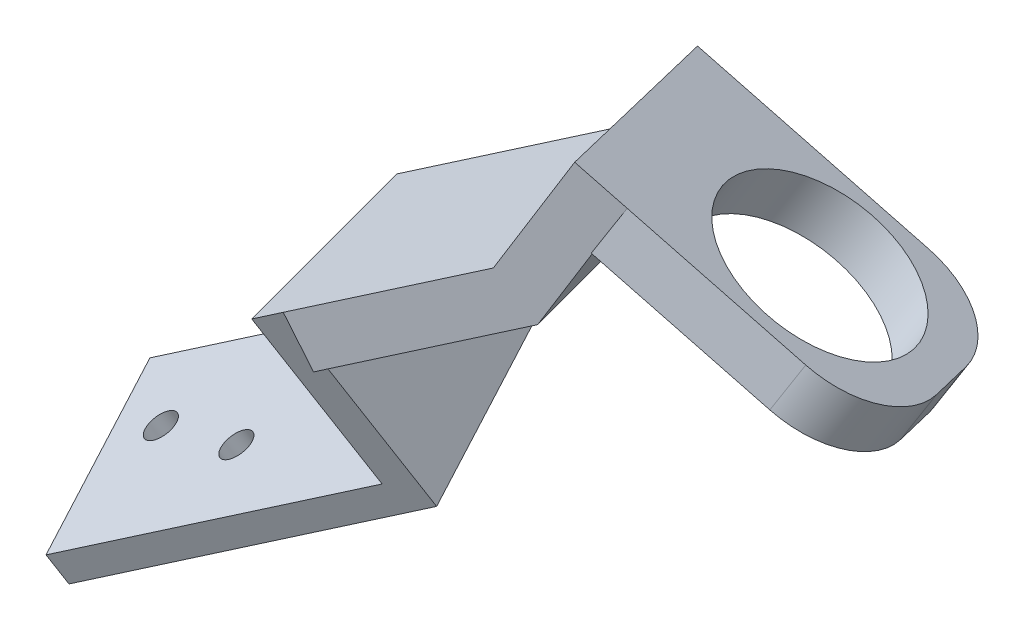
ISO-10303-21;
HEADER;
FILE_DESCRIPTION(('STEP AP214'),'2;1');
FILE_NAME('part.step','',(''),(''),'','','');
FILE_SCHEMA(('AUTOMOTIVE_DESIGN { 1 0 10303 214 1 1 1 1 }'));
ENDSEC;
DATA;
#1=APPLICATION_CONTEXT('core data for automotive mechanical design processes');
#2=APPLICATION_PROTOCOL_DEFINITION('international standard','automotive_design',2000,#1);
#3=PRODUCT_CONTEXT('',#1,'mechanical');
#4=PRODUCT('Part','Part','',(#3));
#5=PRODUCT_RELATED_PRODUCT_CATEGORY('part','',(#4));
#6=PRODUCT_DEFINITION_FORMATION('','',#4);
#7=PRODUCT_DEFINITION_CONTEXT('part definition',#1,'design');
#8=PRODUCT_DEFINITION('design','',#6,#7);
#9=PRODUCT_DEFINITION_SHAPE('','',#8);
#10=(LENGTH_UNIT() NAMED_UNIT(*) SI_UNIT(.MILLI.,.METRE.));
#11=(NAMED_UNIT(*) PLANE_ANGLE_UNIT() SI_UNIT($,.RADIAN.));
#12=(NAMED_UNIT(*) SI_UNIT($,.STERADIAN.) SOLID_ANGLE_UNIT());
#13=UNCERTAINTY_MEASURE_WITH_UNIT(LENGTH_MEASURE(1.E-05),#10,'distance_accuracy_value','');
#14=(GEOMETRIC_REPRESENTATION_CONTEXT(3) GLOBAL_UNCERTAINTY_ASSIGNED_CONTEXT((#13)) GLOBAL_UNIT_ASSIGNED_CONTEXT((#10,
#11,#12)) REPRESENTATION_CONTEXT('',''));
#15=CARTESIAN_POINT('',(0.,0.,0.));
#16=DIRECTION('',(0.,0.,1.));
#17=DIRECTION('',(1.,0.,0.));
#18=AXIS2_PLACEMENT_3D('',#15,#16,#17);
#19=CARTESIAN_POINT('',(-0.769203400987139,77.3547313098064,26.4639603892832));
#20=DIRECTION('',(-0.338752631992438,-0.15038373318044,-0.928779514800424));
#21=DIRECTION('',(-0.939463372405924,0.,0.342649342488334));
#22=AXIS2_PLACEMENT_3D('',#19,#20,#21);
#23=PLANE('',#22);
#24=DIRECTION('',(0.836516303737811,-0.499999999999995,-0.224143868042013));
#25=VECTOR('',#24,1.);
#26=CARTESIAN_POINT('',(-0.769203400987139,77.3547313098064,26.4639603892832));
#27=LINE('',#26,#25);
#28=CARTESIAN_POINT('',(-21.6821109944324,89.8547313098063,32.0675570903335));
#29=VERTEX_POINT('',#28);
#30=CARTESIAN_POINT('',(-7.46133383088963,81.3547313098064,28.2571113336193));
#31=VERTEX_POINT('',#30);
#32=EDGE_CURVE('E293',#29,#31,#27,.T.);
#33=ORIENTED_EDGE('',*,*,#32,.T.);
#34=DIRECTION('',(0.430682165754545,0.852868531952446,-0.295174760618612));
#35=VECTOR('',#34,1.);
#36=CARTESIAN_POINT('',(-7.46133383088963,81.3547313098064,28.2571113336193));
#37=LINE('',#36,#35);
#38=CARTESIAN_POINT('',(-5.30792300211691,85.6190739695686,26.7812375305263));
#39=VERTEX_POINT('',#38);
#40=EDGE_CURVE('E165',#31,#39,#37,.T.);
#41=ORIENTED_EDGE('',*,*,#40,.T.);
#42=DIRECTION('',(0.836516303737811,-0.499999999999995,-0.224143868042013));
#43=VECTOR('',#42,1.);
#44=CARTESIAN_POINT('',(1.38420742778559,81.6190739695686,24.9880865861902));
#45=LINE('',#44,#43);
#46=CARTESIAN_POINT('',(-19.5287001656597,94.1190739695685,30.5916832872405));
#47=VERTEX_POINT('',#46);
#48=EDGE_CURVE('E159',#47,#39,#45,.T.);
#49=ORIENTED_EDGE('',*,*,#48,.F.);
#50=DIRECTION('',(0.430682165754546,0.852868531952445,-0.295174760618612));
#51=VECTOR('',#50,1.);
#52=CARTESIAN_POINT('',(-21.6821109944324,89.8547313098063,32.0675570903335));
#53=LINE('',#52,#51);
#54=EDGE_CURVE('E162',#29,#47,#53,.T.);
#55=ORIENTED_EDGE('',*,*,#54,.F.);
#56=EDGE_LOOP('',(#33,#41,#49,#55));
#57=FACE_BOUND('',#56,.T.);
#58=ADVANCED_FACE('F37',(#57),#23,.F.);
#59=CARTESIAN_POINT('',(1.38420742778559,81.6190739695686,24.9880865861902));
#60=DIRECTION('',(-0.430682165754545,-0.852868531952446,0.295174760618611));
#61=DIRECTION('',(0.89264171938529,-0.450766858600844,0.));
#62=AXIS2_PLACEMENT_3D('',#59,#60,#61);
#63=PLANE('',#62);
#64=ORIENTED_EDGE('',*,*,#48,.T.);
#65=CARTESIAN_POINT('',(-8.01794405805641,84.4160041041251,19.3510014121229));
#66=DIRECTION('',(-0.430682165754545,-0.852868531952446,0.295174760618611));
#67=DIRECTION('',(0.89264171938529,-0.450766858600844,0.));
#68=AXIS2_PLACEMENT_3D('',#65,#66,#67);
#69=CIRCLE('',#68,8.);
#70=CARTESIAN_POINT('',(-1.32581362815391,80.4160041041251,17.5578504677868));
#71=VERTEX_POINT('',#70);
#72=EDGE_CURVE('E304',#39,#71,#69,.F.);
#73=ORIENTED_EDGE('',*,*,#72,.T.);
#74=DIRECTION('',(0.338752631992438,0.150383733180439,0.928779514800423));
#75=VECTOR('',#74,1.);
#76=CARTESIAN_POINT('',(1.38420742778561,81.6190739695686,24.9880865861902));
#77=LINE('',#76,#75);
#78=CARTESIAN_POINT('',(-3.02802517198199,79.6603349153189,12.89078942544));
#79=VERTEX_POINT('',#78);
#80=EDGE_CURVE('E316',#79,#71,#77,.T.);
#81=ORIENTED_EDGE('',*,*,#80,.F.);
#82=CARTESIAN_POINT('',(-9.72015560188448,83.6603349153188,14.6839403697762));
#83=DIRECTION('',(-0.430682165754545,-0.852868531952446,0.295174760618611));
#84=DIRECTION('',(0.89264171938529,-0.450766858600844,0.));
#85=AXIS2_PLACEMENT_3D('',#82,#83,#84);
#86=CIRCLE('',#85,8.);
#87=CARTESIAN_POINT('',(-12.430176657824,82.4572650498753,7.25370425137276));
#88=VERTEX_POINT('',#87);
#89=EDGE_CURVE('E302',#79,#88,#86,.F.);
#90=ORIENTED_EDGE('',*,*,#89,.T.);
#91=DIRECTION('',(0.836516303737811,-0.499999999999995,-0.224143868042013));
#92=VECTOR('',#91,1.);
#93=CARTESIAN_POINT('',(-5.73804622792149,78.4572650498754,5.46055330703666));
#94=LINE('',#93,#92);
#95=CARTESIAN_POINT('',(-26.6509538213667,90.9572650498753,11.064150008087));
#96=VERTEX_POINT('',#95);
#97=EDGE_CURVE('E169',#96,#88,#94,.T.);
#98=ORIENTED_EDGE('',*,*,#97,.F.);
#99=DIRECTION('',(0.836516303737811,-0.499999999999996,-0.224143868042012));
#100=VECTOR('',#99,1.);
#101=CARTESIAN_POINT('',(-45.0543125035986,101.957265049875,15.9953151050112));
#102=LINE('',#101,#100);
#103=CARTESIAN_POINT('',(-30.8335353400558,93.4572650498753,12.184869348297));
#104=VERTEX_POINT('',#103);
#105=EDGE_CURVE('E191',#104,#96,#102,.T.);
#106=ORIENTED_EDGE('',*,*,#105,.F.);
#107=DIRECTION('',(-0.338752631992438,-0.150383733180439,-0.928779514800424));
#108=VECTOR('',#107,1.);
#109=CARTESIAN_POINT('',(-41.3576372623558,88.7852608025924,-16.6697264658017));
#110=LINE('',#109,#108);
#111=CARTESIAN_POINT('',(-23.7112816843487,96.6190739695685,31.7124026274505));
#112=VERTEX_POINT('',#111);
#113=EDGE_CURVE('E186',#112,#104,#110,.T.);
#114=ORIENTED_EDGE('',*,*,#113,.F.);
#115=DIRECTION('',(0.836516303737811,-0.499999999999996,-0.224143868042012));
#116=VECTOR('',#115,1.);
#117=CARTESIAN_POINT('',(-37.9320588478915,105.119073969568,35.5228483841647));
#118=LINE('',#117,#116);
#119=EDGE_CURVE('E182',#112,#47,#118,.T.);
#120=ORIENTED_EDGE('',*,*,#119,.T.);
#121=EDGE_LOOP('',(#64,#73,#81,#90,#98,#106,#114,#120));
#122=FACE_BOUND('',#121,.T.);
#123=CARTESIAN_POINT('',(-12.6333731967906,86.288169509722,18.0261182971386));
#124=DIRECTION('',(-0.430682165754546,-0.852868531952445,0.295174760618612));
#125=DIRECTION('',(0.733701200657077,-0.521325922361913,-0.435777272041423));
#126=AXIS2_PLACEMENT_3D('',#123,#124,#125);
#127=CIRCLE('',#126,8.99999999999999);
#128=CARTESIAN_POINT('',(-6.0300623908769,81.5962362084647,14.1041228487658));
#129=VERTEX_POINT('',#128);
#130=EDGE_CURVE('E289',#129,#129,#127,.T.);
#131=ORIENTED_EDGE('',*,*,#130,.T.);
#132=EDGE_LOOP('',(#131));
#133=FACE_BOUND('',#132,.T.);
#134=ADVANCED_FACE('F183',(#122,#133),#63,.F.);
#135=CARTESIAN_POINT('',(-5.73804622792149,78.4572650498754,5.46055330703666));
#136=DIRECTION('',(0.338752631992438,0.15038373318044,0.928779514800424));
#137=DIRECTION('',(0.939463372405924,0.,-0.342649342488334));
#138=AXIS2_PLACEMENT_3D('',#135,#136,#137);
#139=PLANE('',#138);
#140=ORIENTED_EDGE('',*,*,#97,.T.);
#141=DIRECTION('',(-0.430682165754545,-0.852868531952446,0.295174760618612));
#142=VECTOR('',#141,1.);
#143=CARTESIAN_POINT('',(-12.430176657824,82.4572650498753,7.25370425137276));
#144=LINE('',#143,#142);
#145=CARTESIAN_POINT('',(-14.5835874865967,78.1929223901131,8.72957805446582));
#146=VERTEX_POINT('',#145);
#147=EDGE_CURVE('E11',#88,#146,#144,.T.);
#148=ORIENTED_EDGE('',*,*,#147,.T.);
#149=DIRECTION('',(0.836516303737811,-0.499999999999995,-0.224143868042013));
#150=VECTOR('',#149,1.);
#151=CARTESIAN_POINT('',(-7.89145705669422,74.1929223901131,6.93642711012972));
#152=LINE('',#151,#150);
#153=CARTESIAN_POINT('',(-28.8043646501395,86.6929223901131,12.54002381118));
#154=VERTEX_POINT('',#153);
#155=EDGE_CURVE('E295',#154,#146,#152,.T.);
#156=ORIENTED_EDGE('',*,*,#155,.F.);
#157=DIRECTION('',(-0.430682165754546,-0.852868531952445,0.295174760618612));
#158=VECTOR('',#157,1.);
#159=CARTESIAN_POINT('',(-26.6509538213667,90.9572650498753,11.064150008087));
#160=LINE('',#159,#158);
#161=EDGE_CURVE('E178',#96,#154,#160,.T.);
#162=ORIENTED_EDGE('',*,*,#161,.F.);
#163=EDGE_LOOP('',(#140,#148,#156,#162));
#164=FACE_BOUND('',#163,.T.);
#165=ADVANCED_FACE('F343',(#164),#139,.F.);
#166=CARTESIAN_POINT('',(-7.89145705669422,74.1929223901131,6.93642711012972));
#167=DIRECTION('',(0.430682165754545,0.852868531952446,-0.295174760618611));
#168=DIRECTION('',(-0.89264171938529,0.450766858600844,0.));
#169=AXIS2_PLACEMENT_3D('',#166,#167,#168);
#170=PLANE('',#169);
#171=DIRECTION('',(0.338752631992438,0.150383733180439,0.928779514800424));
#172=VECTOR('',#171,1.);
#173=CARTESIAN_POINT('',(-7.89145705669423,74.1929223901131,6.93642711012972));
#174=LINE('',#173,#172);
#175=CARTESIAN_POINT('',(-5.18143600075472,75.3959922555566,14.3666632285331));
#176=VERTEX_POINT('',#175);
#177=CARTESIAN_POINT('',(-3.47922445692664,76.1516614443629,19.0337242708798));
#178=VERTEX_POINT('',#177);
#179=EDGE_CURVE('E168',#176,#178,#174,.T.);
#180=ORIENTED_EDGE('',*,*,#179,.T.);
#181=CARTESIAN_POINT('',(-10.1713548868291,80.1516614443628,20.8268752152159));
#182=DIRECTION('',(0.430682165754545,0.852868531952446,-0.295174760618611));
#183=DIRECTION('',(-0.89264171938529,0.450766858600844,0.));
#184=AXIS2_PLACEMENT_3D('',#181,#182,#183);
#185=CIRCLE('',#184,8.);
#186=EDGE_CURVE('E45',#178,#31,#185,.F.);
#187=ORIENTED_EDGE('',*,*,#186,.T.);
#188=ORIENTED_EDGE('',*,*,#32,.F.);
#189=DIRECTION('',(0.338752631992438,0.150383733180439,0.928779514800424));
#190=VECTOR('',#189,1.);
#191=CARTESIAN_POINT('',(-28.8043646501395,86.6929223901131,12.54002381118));
#192=LINE('',#191,#190);
#193=CARTESIAN_POINT('',(-21.9807671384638,89.7221477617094,31.2487126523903));
#194=VERTEX_POINT('',#193);
#195=EDGE_CURVE('E177',#194,#29,#192,.T.);
#196=ORIENTED_EDGE('',*,*,#195,.F.);
#197=EDGE_CURVE('E329',#154,#194,#192,.T.);
#198=ORIENTED_EDGE('',*,*,#197,.F.);
#199=ORIENTED_EDGE('',*,*,#155,.T.);
#200=CARTESIAN_POINT('',(-11.8735664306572,79.3959922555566,16.1598141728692));
#201=DIRECTION('',(0.430682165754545,0.852868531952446,-0.295174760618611));
#202=DIRECTION('',(-0.89264171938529,0.450766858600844,0.));
#203=AXIS2_PLACEMENT_3D('',#200,#201,#202);
#204=CIRCLE('',#203,8.);
#205=EDGE_CURVE('E52',#146,#176,#204,.F.);
#206=ORIENTED_EDGE('',*,*,#205,.T.);
#207=EDGE_LOOP('',(#180,#187,#188,#196,#198,#199,#206));
#208=FACE_BOUND('',#207,.T.);
#209=CARTESIAN_POINT('',(-14.7867840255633,82.0238268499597,19.5019921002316));
#210=DIRECTION('',(-0.430682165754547,-0.852868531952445,0.295174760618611));
#211=DIRECTION('',(0.733701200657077,-0.521325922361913,-0.435777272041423));
#212=AXIS2_PLACEMENT_3D('',#209,#210,#211);
#213=CIRCLE('',#212,8.99999999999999);
#214=CARTESIAN_POINT('',(-8.18347321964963,77.3318935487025,15.5799966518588));
#215=VERTEX_POINT('',#214);
#216=EDGE_CURVE('E179',#215,#215,#213,.T.);
#217=ORIENTED_EDGE('',*,*,#216,.F.);
#218=EDGE_LOOP('',(#217));
#219=FACE_BOUND('',#218,.T.);
#220=ADVANCED_FACE('F311',(#208,#219),#170,.F.);
#221=CARTESIAN_POINT('',(-27.0124666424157,104.150635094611,-19.7156185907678));
#222=DIRECTION('',(0.836516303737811,-0.499999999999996,-0.224143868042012));
#223=DIRECTION('',(-0.513054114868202,-0.858356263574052,0.));
#224=AXIS2_PLACEMENT_3D('',#221,#222,#223);
#225=PLANE('',#224);
#226=ORIENTED_EDGE('',*,*,#197,.T.);
#227=DIRECTION('',(-0.482962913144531,-0.866025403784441,0.129409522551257));
#228=VECTOR('',#227,1.);
#229=CARTESIAN_POINT('',(-13.9343238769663,104.150635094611,29.0926746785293));
#230=LINE('',#229,#228);
#231=CARTESIAN_POINT('',(-26.6554443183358,81.3397459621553,32.5012886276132));
#232=VERTEX_POINT('',#231);
#233=EDGE_CURVE('E195',#194,#232,#230,.T.);
#234=ORIENTED_EDGE('',*,*,#233,.T.);
#235=DIRECTION('',(0.258819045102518,0.,0.965925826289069));
#236=VECTOR('',#235,1.);
#237=CARTESIAN_POINT('',(-39.7335870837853,81.3397459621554,-16.3070046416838));
#238=LINE('',#237,#236);
#239=CARTESIAN_POINT('',(-32.0144281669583,81.3397459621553,12.5012886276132));
#240=VERTEX_POINT('',#239);
#241=EDGE_CURVE('E197',#240,#232,#238,.T.);
#242=ORIENTED_EDGE('',*,*,#241,.F.);
#243=DIRECTION('',(0.482962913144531,0.866025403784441,-0.129409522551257));
#244=VECTOR('',#243,1.);
#245=CARTESIAN_POINT('',(-19.2933077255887,104.150635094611,9.09267467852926));
#246=LINE('',#245,#244);
#247=EDGE_CURVE('E200',#240,#96,#246,.T.);
#248=ORIENTED_EDGE('',*,*,#247,.T.);
#249=ORIENTED_EDGE('',*,*,#161,.T.);
#250=EDGE_LOOP('',(#226,#234,#242,#248,#249));
#251=FACE_BOUND('',#250,.T.);
#252=ADVANCED_FACE('F334',(#251),#225,.T.);
#253=CARTESIAN_POINT('',(-38.9309232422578,58.2696739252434,30.4315094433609));
#254=DIRECTION('',(-0.836516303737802,-0.500000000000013,0.224143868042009));
#255=DIRECTION('',(-0.399519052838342,0.836516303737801,0.375000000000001));
#256=AXIS2_PLACEMENT_3D('',#253,#254,#255);
#257=PLANE('',#256);
#258=DIRECTION('',(0.258819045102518,0.,0.965925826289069));
#259=VECTOR('',#258,1.);
#260=CARTESIAN_POINT('',(-49.8654735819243,70.6698729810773,17.2844618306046));
#261=LINE('',#260,#259);
#262=CARTESIAN_POINT('',(-49.8654735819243,70.6698729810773,17.2844618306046));
#263=VERTEX_POINT('',#262);
#264=CARTESIAN_POINT('',(-44.853241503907,70.6698729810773,35.990366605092));
#265=VERTEX_POINT('',#264);
#266=EDGE_CURVE('E213',#263,#265,#261,.T.);
#267=ORIENTED_EDGE('',*,*,#266,.T.);
#268=DIRECTION('',(0.399519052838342,-0.836516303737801,-0.375000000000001));
#269=VECTOR('',#268,1.);
#270=CARTESIAN_POINT('',(-38.9309232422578,58.2696739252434,30.4315094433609));
#271=LINE('',#270,#269);
#272=CARTESIAN_POINT('',(-38.9309232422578,58.2696739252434,30.4315094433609));
#273=VERTEX_POINT('',#272);
#274=EDGE_CURVE('E256',#265,#273,#271,.T.);
#275=ORIENTED_EDGE('',*,*,#274,.T.);
#276=DIRECTION('',(-0.375,0.22414386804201,-0.89951905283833));
#277=VECTOR('',#276,1.);
#278=CARTESIAN_POINT('',(-38.9309232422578,58.2696739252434,30.4315094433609));
#279=LINE('',#278,#277);
#280=CARTESIAN_POINT('',(-46.4309232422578,62.7525512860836,12.4411283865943));
#281=VERTEX_POINT('',#280);
#282=EDGE_CURVE('E277',#273,#281,#279,.T.);
#283=ORIENTED_EDGE('',*,*,#282,.T.);
#284=DIRECTION('',(0.399519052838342,-0.836516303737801,-0.375000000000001));
#285=VECTOR('',#284,1.);
#286=CARTESIAN_POINT('',(-46.4309232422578,62.7525512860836,12.4411283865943));
#287=LINE('',#286,#285);
#288=CARTESIAN_POINT('',(-52.280288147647,74.9999999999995,17.9315094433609));
#289=VERTEX_POINT('',#288);
#290=EDGE_CURVE('E271',#289,#281,#287,.T.);
#291=ORIENTED_EDGE('',*,*,#290,.F.);
#292=DIRECTION('',(0.482962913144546,-0.866025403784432,-0.129409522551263));
#293=VECTOR('',#292,1.);
#294=CARTESIAN_POINT('',(-52.280288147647,74.9999999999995,17.9315094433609));
#295=LINE('',#294,#293);
#296=EDGE_CURVE('E215',#289,#263,#295,.T.);
#297=ORIENTED_EDGE('',*,*,#296,.T.);
#298=EDGE_LOOP('',(#267,#275,#283,#291,#297));
#299=FACE_BOUND('',#298,.T.);
#300=ADVANCED_FACE('F363',(#299),#257,.F.);
#301=CARTESIAN_POINT('',(-69.4075510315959,43.2792228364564,39.4015448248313));
#302=DIRECTION('',(0.836516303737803,0.50000000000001,-0.22414386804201));
#303=DIRECTION('',(0.375,-0.22414386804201,0.89951905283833));
#304=AXIS2_PLACEMENT_3D('',#301,#302,#303);
#305=PLANE('',#304);
#306=DIRECTION('',(-0.39951905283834,0.836516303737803,0.375));
#307=VECTOR('',#306,1.);
#308=CARTESIAN_POINT('',(-76.9075510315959,47.7621001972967,21.4111637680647));
#309=LINE('',#308,#307);
#310=CARTESIAN_POINT('',(-75.7089938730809,45.2525512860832,20.2861637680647));
#311=VERTEX_POINT('',#310);
#312=CARTESIAN_POINT('',(-76.9075510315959,47.7621001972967,21.4111637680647));
#313=VERTEX_POINT('',#312);
#314=EDGE_CURVE('E242',#311,#313,#309,.T.);
#315=ORIENTED_EDGE('',*,*,#314,.F.);
#316=DIRECTION('',(-0.375,0.22414386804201,-0.89951905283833));
#317=VECTOR('',#316,1.);
#318=CARTESIAN_POINT('',(-68.2089938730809,40.769673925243,38.2765448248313));
#319=LINE('',#318,#317);
#320=CARTESIAN_POINT('',(-68.2089938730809,40.769673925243,38.2765448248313));
#321=VERTEX_POINT('',#320);
#322=EDGE_CURVE('E262',#321,#311,#319,.T.);
#323=ORIENTED_EDGE('',*,*,#322,.F.);
#324=DIRECTION('',(-0.39951905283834,0.836516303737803,0.375));
#325=VECTOR('',#324,1.);
#326=CARTESIAN_POINT('',(-69.4075510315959,43.2792228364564,39.4015448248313));
#327=LINE('',#326,#325);
#328=CARTESIAN_POINT('',(-69.4075510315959,43.2792228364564,39.4015448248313));
#329=VERTEX_POINT('',#328);
#330=EDGE_CURVE('E243',#321,#329,#327,.T.);
#331=ORIENTED_EDGE('',*,*,#330,.T.);
#332=DIRECTION('',(-0.375,0.22414386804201,-0.89951905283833));
#333=VECTOR('',#332,1.);
#334=CARTESIAN_POINT('',(-69.4075510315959,43.2792228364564,39.4015448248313));
#335=LINE('',#334,#333);
#336=EDGE_CURVE('E283',#329,#313,#335,.T.);
#337=ORIENTED_EDGE('',*,*,#336,.T.);
#338=EDGE_LOOP('',(#315,#323,#331,#337));
#339=FACE_BOUND('',#338,.T.);
#340=ADVANCED_FACE('F359',(#339),#305,.F.);
#341=CARTESIAN_POINT('',(-42.6390293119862,59.2792228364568,32.2289410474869));
#342=DIRECTION('',(0.399519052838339,-0.836516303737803,-0.375));
#343=DIRECTION('',(-0.836516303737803,-0.50000000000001,0.22414386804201));
#344=AXIS2_PLACEMENT_3D('',#341,#342,#343);
#345=PLANE('',#344);
#346=CARTESIAN_POINT('',(-69.7249695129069,48.4689492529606,27.4865968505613));
#347=DIRECTION('',(-0.399519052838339,0.836516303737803,0.375));
#348=DIRECTION('',(-0.836516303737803,-0.50000000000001,0.22414386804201));
#349=AXIS2_PLACEMENT_3D('',#346,#347,#348);
#350=CIRCLE('',#349,1.5);
#351=CARTESIAN_POINT('',(-70.9797439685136,47.7189492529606,27.8228126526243));
#352=VERTEX_POINT('',#351);
#353=EDGE_CURVE('E233',#352,#352,#350,.T.);
#354=ORIENTED_EDGE('',*,*,#353,.F.);
#355=EDGE_LOOP('',(#354));
#356=FACE_BOUND('',#355,.T.);
#357=CARTESIAN_POINT('',(-60.5581709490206,52.1549494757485,29.0303605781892));
#358=DIRECTION('',(-0.399519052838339,0.836516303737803,0.375));
#359=DIRECTION('',(-0.836516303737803,-0.50000000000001,0.22414386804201));
#360=AXIS2_PLACEMENT_3D('',#357,#358,#359);
#361=CIRCLE('',#360,1.5);
#362=CARTESIAN_POINT('',(-61.8129454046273,51.4049494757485,29.3665763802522));
#363=VERTEX_POINT('',#362);
#364=EDGE_CURVE('E239',#363,#363,#361,.T.);
#365=ORIENTED_EDGE('',*,*,#364,.F.);
#366=EDGE_LOOP('',(#365));
#367=FACE_BOUND('',#366,.T.);
#368=DIRECTION('',(0.836516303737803,0.50000000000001,-0.22414386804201));
#369=VECTOR('',#368,1.);
#370=CARTESIAN_POINT('',(-50.1390293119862,63.762100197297,14.2385599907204));
#371=LINE('',#370,#369);
#372=CARTESIAN_POINT('',(-50.1390293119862,63.762100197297,14.2385599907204));
#373=VERTEX_POINT('',#372);
#374=EDGE_CURVE('E265',#313,#373,#371,.T.);
#375=ORIENTED_EDGE('',*,*,#374,.F.);
#376=ORIENTED_EDGE('',*,*,#336,.F.);
#377=DIRECTION('',(0.836516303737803,0.50000000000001,-0.22414386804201));
#378=VECTOR('',#377,1.);
#379=CARTESIAN_POINT('',(-42.6390293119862,59.2792228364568,32.2289410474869));
#380=LINE('',#379,#378);
#381=CARTESIAN_POINT('',(-42.6390293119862,59.2792228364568,32.2289410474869));
#382=VERTEX_POINT('',#381);
#383=EDGE_CURVE('E246',#329,#382,#380,.T.);
#384=ORIENTED_EDGE('',*,*,#383,.T.);
#385=DIRECTION('',(-0.375,0.22414386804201,-0.89951905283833));
#386=VECTOR('',#385,1.);
#387=CARTESIAN_POINT('',(-42.6390293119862,59.2792228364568,32.2289410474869));
#388=LINE('',#387,#386);
#389=EDGE_CURVE('E280',#382,#373,#388,.T.);
#390=ORIENTED_EDGE('',*,*,#389,.T.);
#391=EDGE_LOOP('',(#375,#376,#384,#390));
#392=FACE_BOUND('',#391,.T.);
#393=ADVANCED_FACE('F362',(#356,#367,#392),#345,.F.);
#394=CARTESIAN_POINT('',(-49.430853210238,73.4999999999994,38.603941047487));
#395=DIRECTION('',(0.836516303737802,0.500000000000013,-0.224143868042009));
#396=DIRECTION('',(0.399519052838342,-0.836516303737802,-0.375000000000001));
#397=AXIS2_PLACEMENT_3D('',#394,#395,#396);
#398=PLANE('',#397);
#399=DIRECTION('',(-0.399519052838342,0.836516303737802,0.375000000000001));
#400=VECTOR('',#399,1.);
#401=CARTESIAN_POINT('',(-56.930853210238,77.9828773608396,20.6135599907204));
#402=LINE('',#401,#400);
#403=CARTESIAN_POINT('',(-54.7898370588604,73.4999999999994,18.603941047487));
#404=VERTEX_POINT('',#403);
#405=EDGE_CURVE('E268',#373,#404,#402,.T.);
#406=ORIENTED_EDGE('',*,*,#405,.F.);
#407=ORIENTED_EDGE('',*,*,#389,.F.);
#408=DIRECTION('',(-0.399519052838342,0.836516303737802,0.375000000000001));
#409=VECTOR('',#408,1.);
#410=CARTESIAN_POINT('',(-49.430853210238,73.4999999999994,38.603941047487));
#411=LINE('',#410,#409);
#412=CARTESIAN_POINT('',(-49.430853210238,73.4999999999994,38.6039410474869));
#413=VERTEX_POINT('',#412);
#414=EDGE_CURVE('E250',#382,#413,#411,.T.);
#415=ORIENTED_EDGE('',*,*,#414,.T.);
#416=DIRECTION('',(0.258819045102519,0.,0.965925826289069));
#417=VECTOR('',#416,1.);
#418=CARTESIAN_POINT('',(-49.430853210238,73.4999999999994,38.603941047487));
#419=LINE('',#418,#417);
#420=EDGE_CURVE('E190',#404,#413,#419,.T.);
#421=ORIENTED_EDGE('',*,*,#420,.F.);
#422=EDGE_LOOP('',(#406,#407,#415,#421));
#423=FACE_BOUND('',#422,.T.);
#424=ADVANCED_FACE('F367',(#423),#398,.F.);
#425=CARTESIAN_POINT('',(-68.2089938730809,40.769673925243,38.2765448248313));
#426=DIRECTION('',(-0.39951905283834,0.836516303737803,0.375));
#427=DIRECTION('',(-0.375,0.22414386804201,-0.89951905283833));
#428=AXIS2_PLACEMENT_3D('',#425,#426,#427);
#429=PLANE('',#428);
#430=CARTESIAN_POINT('',(-68.5264123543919,45.9594003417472,26.3615968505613));
#431=DIRECTION('',(-0.399519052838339,0.836516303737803,0.375));
#432=DIRECTION('',(-0.836516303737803,-0.50000000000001,0.22414386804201));
#433=AXIS2_PLACEMENT_3D('',#430,#431,#432);
#434=CIRCLE('',#433,1.5);
#435=CARTESIAN_POINT('',(-69.7811868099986,45.2094003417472,26.6978126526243));
#436=VERTEX_POINT('',#435);
#437=EDGE_CURVE('E230',#436,#436,#434,.T.);
#438=ORIENTED_EDGE('',*,*,#437,.T.);
#439=EDGE_LOOP('',(#438));
#440=FACE_BOUND('',#439,.T.);
#441=CARTESIAN_POINT('',(-59.3596137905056,49.6454005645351,27.9053605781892));
#442=DIRECTION('',(-0.399519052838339,0.836516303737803,0.375));
#443=DIRECTION('',(-0.836516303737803,-0.50000000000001,0.22414386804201));
#444=AXIS2_PLACEMENT_3D('',#441,#442,#443);
#445=CIRCLE('',#444,1.5);
#446=CARTESIAN_POINT('',(-60.6143882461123,48.8954005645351,28.2415763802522));
#447=VERTEX_POINT('',#446);
#448=EDGE_CURVE('E236',#447,#447,#445,.T.);
#449=ORIENTED_EDGE('',*,*,#448,.T.);
#450=EDGE_LOOP('',(#449));
#451=FACE_BOUND('',#450,.T.);
#452=DIRECTION('',(-0.836516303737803,-0.50000000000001,0.22414386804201));
#453=VECTOR('',#452,1.);
#454=CARTESIAN_POINT('',(-75.7089938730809,45.2525512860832,20.2861637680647));
#455=LINE('',#454,#453);
#456=EDGE_CURVE('E247',#281,#311,#455,.T.);
#457=ORIENTED_EDGE('',*,*,#456,.F.);
#458=ORIENTED_EDGE('',*,*,#282,.F.);
#459=DIRECTION('',(-0.836516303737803,-0.50000000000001,0.22414386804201));
#460=VECTOR('',#459,1.);
#461=CARTESIAN_POINT('',(-68.2089938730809,40.769673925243,38.2765448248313));
#462=LINE('',#461,#460);
#463=EDGE_CURVE('E260',#273,#321,#462,.T.);
#464=ORIENTED_EDGE('',*,*,#463,.T.);
#465=ORIENTED_EDGE('',*,*,#322,.T.);
#466=EDGE_LOOP('',(#457,#458,#464,#465));
#467=FACE_BOUND('',#466,.T.);
#468=ADVANCED_FACE('F371',(#440,#451,#467),#429,.F.);
#469=CARTESIAN_POINT('',(-68.2089938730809,40.769673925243,38.2765448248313));
#470=DIRECTION('',(-0.375,0.22414386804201,-0.89951905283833));
#471=DIRECTION('',(0.39951905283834,-0.836516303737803,-0.375));
#472=AXIS2_PLACEMENT_3D('',#469,#470,#471);
#473=PLANE('',#472);
#474=ORIENTED_EDGE('',*,*,#330,.F.);
#475=ORIENTED_EDGE('',*,*,#463,.F.);
#476=ORIENTED_EDGE('',*,*,#274,.F.);
#477=CARTESIAN_POINT('',(-46.9213042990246,74.9999999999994,37.9315094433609));
#478=VERTEX_POINT('',#477);
#479=EDGE_CURVE('E257',#478,#265,#271,.T.);
#480=ORIENTED_EDGE('',*,*,#479,.F.);
#481=DIRECTION('',(0.836516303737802,0.500000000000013,-0.224143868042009));
#482=VECTOR('',#481,1.);
#483=CARTESIAN_POINT('',(-46.9213042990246,74.9999999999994,37.9315094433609));
#484=LINE('',#483,#482);
#485=EDGE_CURVE('E253',#413,#478,#484,.T.);
#486=ORIENTED_EDGE('',*,*,#485,.F.);
#487=ORIENTED_EDGE('',*,*,#414,.F.);
#488=ORIENTED_EDGE('',*,*,#383,.F.);
#489=EDGE_LOOP('',(#474,#475,#476,#480,#486,#487,#488));
#490=FACE_BOUND('',#489,.T.);
#491=ADVANCED_FACE('F378',(#490),#473,.F.);
#492=CARTESIAN_POINT('',(-75.7089938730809,45.2525512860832,20.2861637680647));
#493=DIRECTION('',(-0.375,0.22414386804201,-0.89951905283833));
#494=DIRECTION('',(0.39951905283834,-0.836516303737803,-0.375));
#495=AXIS2_PLACEMENT_3D('',#492,#493,#494);
#496=PLANE('',#495);
#497=DIRECTION('',(0.836516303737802,0.500000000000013,-0.224143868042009));
#498=VECTOR('',#497,1.);
#499=CARTESIAN_POINT('',(-81.5583587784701,57.499999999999,25.7765448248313));
#500=LINE('',#499,#498);
#501=EDGE_CURVE('E286',#404,#289,#500,.T.);
#502=ORIENTED_EDGE('',*,*,#501,.T.);
#503=ORIENTED_EDGE('',*,*,#290,.T.);
#504=ORIENTED_EDGE('',*,*,#456,.T.);
#505=ORIENTED_EDGE('',*,*,#314,.T.);
#506=ORIENTED_EDGE('',*,*,#374,.T.);
#507=ORIENTED_EDGE('',*,*,#405,.T.);
#508=EDGE_LOOP('',(#502,#503,#504,#505,#506,#507));
#509=FACE_BOUND('',#508,.T.);
#510=ADVANCED_FACE('F380',(#509),#496,.T.);
#511=CARTESIAN_POINT('',(-67.3499948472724,66.3757266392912,35.4053605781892));
#512=DIRECTION('',(0.399519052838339,-0.836516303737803,-0.375));
#513=DIRECTION('',(-0.836516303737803,-0.50000000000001,0.22414386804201));
#514=AXIS2_PLACEMENT_3D('',#511,#512,#513);
#515=CYLINDRICAL_SURFACE('',#514,1.5);
#516=ORIENTED_EDGE('',*,*,#448,.F.);
#517=EDGE_LOOP('',(#516));
#518=FACE_BOUND('',#517,.T.);
#519=ORIENTED_EDGE('',*,*,#364,.T.);
#520=EDGE_LOOP('',(#519));
#521=FACE_BOUND('',#520,.T.);
#522=ADVANCED_FACE('F383',(#518,#521),#515,.F.);
#523=CARTESIAN_POINT('',(-76.5167934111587,62.6897264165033,33.8615968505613));
#524=DIRECTION('',(0.399519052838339,-0.836516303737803,-0.375));
#525=DIRECTION('',(-0.836516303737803,-0.50000000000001,0.22414386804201));
#526=AXIS2_PLACEMENT_3D('',#523,#524,#525);
#527=CYLINDRICAL_SURFACE('',#526,1.5);
#528=ORIENTED_EDGE('',*,*,#437,.F.);
#529=EDGE_LOOP('',(#528));
#530=FACE_BOUND('',#529,.T.);
#531=ORIENTED_EDGE('',*,*,#353,.T.);
#532=EDGE_LOOP('',(#531));
#533=FACE_BOUND('',#532,.T.);
#534=ADVANCED_FACE('F390',(#530,#533),#527,.F.);
#535=CARTESIAN_POINT('',(-27.7761636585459,80.6698729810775,32.8015844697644));
#536=DIRECTION('',(-0.258819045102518,0.,-0.965925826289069));
#537=DIRECTION('',(0.482962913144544,-0.866025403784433,-0.129409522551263));
#538=AXIS2_PLACEMENT_3D('',#535,#536,#537);
#539=PLANE('',#538);
#540=DIRECTION('',(0.482962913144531,0.866025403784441,-0.129409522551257));
#541=VECTOR('',#540,1.);
#542=CARTESIAN_POINT('',(-30.1909782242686,84.9999999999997,33.4486320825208));
#543=LINE('',#542,#541);
#544=CARTESIAN_POINT('',(-30.1909782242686,84.9999999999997,33.4486320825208));
#545=VERTEX_POINT('',#544);
#546=EDGE_CURVE('E202',#545,#112,#543,.T.);
#547=ORIENTED_EDGE('',*,*,#546,.F.);
#548=DIRECTION('',(-0.836516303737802,-0.500000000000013,0.224143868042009));
#549=VECTOR('',#548,1.);
#550=CARTESIAN_POINT('',(-30.1909782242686,84.9999999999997,33.4486320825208));
#551=LINE('',#550,#549);
#552=EDGE_CURVE('E227',#545,#478,#551,.T.);
#553=ORIENTED_EDGE('',*,*,#552,.T.);
#554=DIRECTION('',(-0.482962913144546,0.866025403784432,0.129409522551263));
#555=VECTOR('',#554,1.);
#556=CARTESIAN_POINT('',(-44.5064897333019,70.6698729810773,37.2844618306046));
#557=LINE('',#556,#555);
#558=CARTESIAN_POINT('',(-44.5064897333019,70.6698729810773,37.2844618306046));
#559=VERTEX_POINT('',#558);
#560=EDGE_CURVE('E208',#559,#478,#557,.T.);
#561=ORIENTED_EDGE('',*,*,#560,.F.);
#562=DIRECTION('',(-0.836516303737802,-0.500000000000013,0.224143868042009));
#563=VECTOR('',#562,1.);
#564=CARTESIAN_POINT('',(-27.7761636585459,80.6698729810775,32.8015844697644));
#565=LINE('',#564,#563);
#566=EDGE_CURVE('E212',#232,#559,#565,.T.);
#567=ORIENTED_EDGE('',*,*,#566,.F.);
#568=ORIENTED_EDGE('',*,*,#233,.F.);
#569=EDGE_CURVE('E175',#47,#194,#230,.T.);
#570=ORIENTED_EDGE('',*,*,#569,.F.);
#571=ORIENTED_EDGE('',*,*,#119,.F.);
#572=EDGE_LOOP('',(#547,#553,#561,#567,#568,#570,#571));
#573=FACE_BOUND('',#572,.T.);
#574=ADVANCED_FACE('F193',(#573),#539,.F.);
#575=CARTESIAN_POINT('',(-30.1909782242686,84.9999999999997,33.4486320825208));
#576=DIRECTION('',(0.482962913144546,-0.866025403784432,-0.129409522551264));
#577=DIRECTION('',(0.258819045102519,0.,0.965925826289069));
#578=AXIS2_PLACEMENT_3D('',#575,#576,#577);
#579=PLANE('',#578);
#580=ORIENTED_EDGE('',*,*,#552,.F.);
#581=DIRECTION('',(-0.258819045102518,0.,-0.965925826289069));
#582=VECTOR('',#581,1.);
#583=CARTESIAN_POINT('',(-30.1909782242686,84.9999999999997,33.4486320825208));
#584=LINE('',#583,#582);
#585=CARTESIAN_POINT('',(-35.549962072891,84.9999999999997,13.4486320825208));
#586=VERTEX_POINT('',#585);
#587=EDGE_CURVE('E209',#545,#586,#584,.T.);
#588=ORIENTED_EDGE('',*,*,#587,.T.);
#589=DIRECTION('',(-0.836516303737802,-0.500000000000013,0.224143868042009));
#590=VECTOR('',#589,1.);
#591=CARTESIAN_POINT('',(-35.549962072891,84.9999999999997,13.4486320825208));
#592=LINE('',#591,#590);
#593=EDGE_CURVE('E225',#586,#289,#592,.T.);
#594=ORIENTED_EDGE('',*,*,#593,.T.);
#595=ORIENTED_EDGE('',*,*,#501,.F.);
#596=ORIENTED_EDGE('',*,*,#420,.T.);
#597=ORIENTED_EDGE('',*,*,#485,.T.);
#598=EDGE_LOOP('',(#580,#588,#594,#595,#596,#597));
#599=FACE_BOUND('',#598,.T.);
#600=ADVANCED_FACE('F397',(#599),#579,.F.);
#601=CARTESIAN_POINT('',(-35.549962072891,84.9999999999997,13.4486320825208));
#602=DIRECTION('',(0.258819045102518,0.,0.965925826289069));
#603=DIRECTION('',(-0.482962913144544,0.866025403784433,0.129409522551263));
#604=AXIS2_PLACEMENT_3D('',#601,#602,#603);
#605=PLANE('',#604);
#606=ORIENTED_EDGE('',*,*,#247,.F.);
#607=DIRECTION('',(-0.836516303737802,-0.500000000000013,0.224143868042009));
#608=VECTOR('',#607,1.);
#609=CARTESIAN_POINT('',(-33.1351475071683,80.6698729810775,12.8015844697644));
#610=LINE('',#609,#608);
#611=EDGE_CURVE('E223',#240,#263,#610,.T.);
#612=ORIENTED_EDGE('',*,*,#611,.T.);
#613=ORIENTED_EDGE('',*,*,#296,.F.);
#614=ORIENTED_EDGE('',*,*,#593,.F.);
#615=DIRECTION('',(-0.482962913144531,-0.866025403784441,0.129409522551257));
#616=VECTOR('',#615,1.);
#617=CARTESIAN_POINT('',(-35.549962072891,84.9999999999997,13.4486320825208));
#618=LINE('',#617,#616);
#619=EDGE_CURVE('E206',#104,#586,#618,.T.);
#620=ORIENTED_EDGE('',*,*,#619,.F.);
#621=ORIENTED_EDGE('',*,*,#105,.T.);
#622=EDGE_LOOP('',(#606,#612,#613,#614,#620,#621));
#623=FACE_BOUND('',#622,.T.);
#624=ADVANCED_FACE('F338',(#623),#605,.F.);
#625=CARTESIAN_POINT('',(-33.1351475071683,80.6698729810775,12.8015844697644));
#626=DIRECTION('',(-0.482962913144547,0.866025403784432,0.129409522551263));
#627=DIRECTION('',(-0.258819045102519,0.,-0.965925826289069));
#628=AXIS2_PLACEMENT_3D('',#625,#626,#627);
#629=PLANE('',#628);
#630=ORIENTED_EDGE('',*,*,#266,.F.);
#631=ORIENTED_EDGE('',*,*,#611,.F.);
#632=ORIENTED_EDGE('',*,*,#241,.T.);
#633=ORIENTED_EDGE('',*,*,#566,.T.);
#634=EDGE_CURVE('E218',#265,#559,#261,.T.);
#635=ORIENTED_EDGE('',*,*,#634,.F.);
#636=EDGE_LOOP('',(#630,#631,#632,#633,#635));
#637=FACE_BOUND('',#636,.T.);
#638=ADVANCED_FACE('F403',(#637),#629,.F.);
#639=CARTESIAN_POINT('',(-46.4309232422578,62.7525512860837,12.4411283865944));
#640=DIRECTION('',(0.836516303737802,0.500000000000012,-0.224143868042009));
#641=DIRECTION('',(0.399519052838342,-0.836516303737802,-0.375));
#642=AXIS2_PLACEMENT_3D('',#639,#640,#641);
#643=PLANE('',#642);
#644=ORIENTED_EDGE('',*,*,#479,.T.);
#645=ORIENTED_EDGE('',*,*,#634,.T.);
#646=ORIENTED_EDGE('',*,*,#560,.T.);
#647=EDGE_LOOP('',(#644,#645,#646));
#648=FACE_BOUND('',#647,.T.);
#649=ADVANCED_FACE('F406',(#648),#643,.F.);
#650=CARTESIAN_POINT('',(-43.269120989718,84.9999999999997,-15.3596611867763));
#651=DIRECTION('',(-0.836516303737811,0.499999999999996,0.224143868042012));
#652=DIRECTION('',(0.513054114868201,0.858356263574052,0.));
#653=AXIS2_PLACEMENT_3D('',#650,#651,#652);
#654=PLANE('',#653);
#655=ORIENTED_EDGE('',*,*,#113,.T.);
#656=ORIENTED_EDGE('',*,*,#619,.T.);
#657=ORIENTED_EDGE('',*,*,#587,.F.);
#658=ORIENTED_EDGE('',*,*,#546,.T.);
#659=EDGE_LOOP('',(#655,#656,#657,#658));
#660=FACE_BOUND('',#659,.T.);
#661=ADVANCED_FACE('F410',(#660),#654,.T.);
#662=CARTESIAN_POINT('',(-58.7674045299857,35.1262756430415,15.7466785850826));
#663=DIRECTION('',(0.836516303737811,-0.499999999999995,-0.224143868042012));
#664=DIRECTION('',(-0.513054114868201,-0.858356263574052,0.));
#665=AXIS2_PLACEMENT_3D('',#662,#663,#664);
#666=PLANE('',#665);
#667=ORIENTED_EDGE('',*,*,#195,.T.);
#668=ORIENTED_EDGE('',*,*,#54,.T.);
#669=ORIENTED_EDGE('',*,*,#569,.T.);
#670=EDGE_LOOP('',(#667,#668,#669));
#671=FACE_BOUND('',#670,.T.);
#672=ADVANCED_FACE('F173',(#671),#666,.F.);
#673=CARTESIAN_POINT('',(-22.1083808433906,67.5250618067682,24.519963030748));
#674=DIRECTION('',(0.430682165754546,0.852868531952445,-0.295174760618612));
#675=DIRECTION('',(0.733701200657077,-0.521325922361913,-0.435777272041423));
#676=AXIS2_PLACEMENT_3D('',#673,#674,#675);
#677=CYLINDRICAL_SURFACE('',#676,8.99999999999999);
#678=ORIENTED_EDGE('',*,*,#130,.F.);
#679=EDGE_LOOP('',(#678));
#680=FACE_BOUND('',#679,.T.);
#681=ORIENTED_EDGE('',*,*,#216,.T.);
#682=EDGE_LOOP('',(#681));
#683=FACE_BOUND('',#682,.T.);
#684=ADVANCED_FACE('F419',(#680,#683),#677,.F.);
#685=CARTESIAN_POINT('',(-30.9169550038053,17.6539340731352,47.126193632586));
#686=DIRECTION('',(-0.836516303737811,0.499999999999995,0.224143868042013));
#687=DIRECTION('',(-0.5130541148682,-0.858356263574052,0.));
#688=AXIS2_PLACEMENT_3D('',#685,#686,#687);
#689=PLANE('',#688);
#690=ORIENTED_EDGE('',*,*,#80,.T.);
#691=DIRECTION('',(0.430682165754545,0.852868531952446,-0.295174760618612));
#692=VECTOR('',#691,1.);
#693=CARTESIAN_POINT('',(-33.6269760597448,16.4508642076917,39.6959575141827));
#694=LINE('',#693,#692);
#695=EDGE_CURVE('E59',#71,#178,#694,.F.);
#696=ORIENTED_EDGE('',*,*,#695,.T.);
#697=ORIENTED_EDGE('',*,*,#179,.F.);
#698=DIRECTION('',(-0.430682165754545,-0.852868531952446,0.295174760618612));
#699=VECTOR('',#698,1.);
#700=CARTESIAN_POINT('',(-35.3291876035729,15.6951950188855,35.0288964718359));
#701=LINE('',#700,#699);
#702=EDGE_CURVE('E306',#176,#79,#701,.F.);
#703=ORIENTED_EDGE('',*,*,#702,.T.);
#704=EDGE_LOOP('',(#690,#696,#697,#703));
#705=FACE_BOUND('',#704,.T.);
#706=ADVANCED_FACE('F318',(#705),#689,.F.);
#707=CARTESIAN_POINT('',(-10.1713548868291,80.1516614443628,20.8268752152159));
#708=DIRECTION('',(0.430682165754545,0.852868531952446,-0.295174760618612));
#709=DIRECTION('',(-0.89264171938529,0.450766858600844,0.));
#710=AXIS2_PLACEMENT_3D('',#707,#708,#709);
#711=CYLINDRICAL_SURFACE('',#710,8.);
#712=ORIENTED_EDGE('',*,*,#186,.F.);
#713=ORIENTED_EDGE('',*,*,#695,.F.);
#714=ORIENTED_EDGE('',*,*,#72,.F.);
#715=ORIENTED_EDGE('',*,*,#40,.F.);
#716=EDGE_LOOP('',(#712,#713,#714,#715));
#717=FACE_BOUND('',#716,.T.);
#718=ADVANCED_FACE('F314',(#717),#711,.T.);
#719=CARTESIAN_POINT('',(-9.72015560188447,83.6603349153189,14.6839403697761));
#720=DIRECTION('',(-0.430682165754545,-0.852868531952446,0.295174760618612));
#721=DIRECTION('',(0.89264171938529,-0.450766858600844,0.));
#722=AXIS2_PLACEMENT_3D('',#719,#720,#721);
#723=CYLINDRICAL_SURFACE('',#722,8.);
#724=ORIENTED_EDGE('',*,*,#89,.F.);
#725=ORIENTED_EDGE('',*,*,#702,.F.);
#726=ORIENTED_EDGE('',*,*,#205,.F.);
#727=ORIENTED_EDGE('',*,*,#147,.F.);
#728=EDGE_LOOP('',(#724,#725,#726,#727));
#729=FACE_BOUND('',#728,.T.);
#730=ADVANCED_FACE('F39',(#729),#723,.T.);
#731=CLOSED_SHELL('',(#58,#134,#165,#220,#252,#300,#340,#393,#424,#468,#491,#510,#522,#534,#574,
#600,#624,#638,#649,#661,#672,#684,#706,#718,#730));
#732=MANIFOLD_SOLID_BREP('B2',#731);
#733=ADVANCED_BREP_SHAPE_REPRESENTATION('',(#18,#732),#14);
#734=SHAPE_DEFINITION_REPRESENTATION(#9,#733);
ENDSEC;
END-ISO-10303-21;
